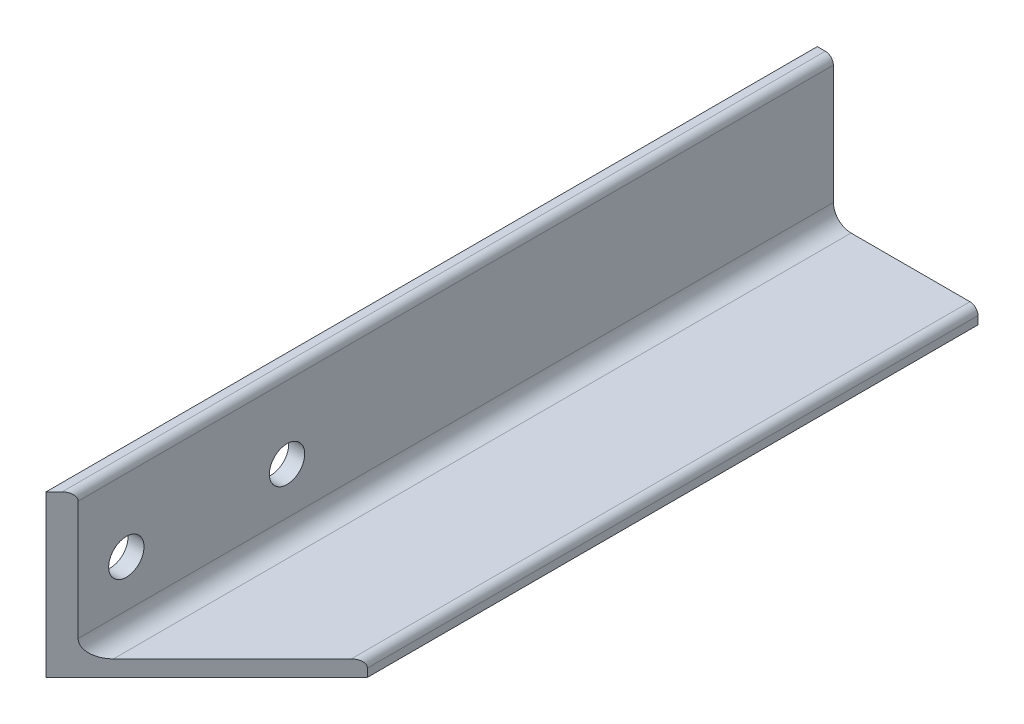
ISO-10303-21;
HEADER;
FILE_DESCRIPTION(('STEP AP214'),'2;1');
FILE_NAME('part.step','',(''),(''),'','','');
FILE_SCHEMA(('AUTOMOTIVE_DESIGN { 1 0 10303 214 1 1 1 1 }'));
ENDSEC;
DATA;
#1=APPLICATION_CONTEXT('core data for automotive mechanical design processes');
#2=APPLICATION_PROTOCOL_DEFINITION('international standard','automotive_design',2000,#1);
#3=PRODUCT_CONTEXT('',#1,'mechanical');
#4=PRODUCT('Part','Part','',(#3));
#5=PRODUCT_RELATED_PRODUCT_CATEGORY('part','',(#4));
#6=PRODUCT_DEFINITION_FORMATION('','',#4);
#7=PRODUCT_DEFINITION_CONTEXT('part definition',#1,'design');
#8=PRODUCT_DEFINITION('design','',#6,#7);
#9=PRODUCT_DEFINITION_SHAPE('','',#8);
#10=(LENGTH_UNIT() NAMED_UNIT(*) SI_UNIT(.MILLI.,.METRE.));
#11=(NAMED_UNIT(*) PLANE_ANGLE_UNIT() SI_UNIT($,.RADIAN.));
#12=(NAMED_UNIT(*) SI_UNIT($,.STERADIAN.) SOLID_ANGLE_UNIT());
#13=UNCERTAINTY_MEASURE_WITH_UNIT(LENGTH_MEASURE(1.E-05),#10,'distance_accuracy_value','');
#14=(GEOMETRIC_REPRESENTATION_CONTEXT(3) GLOBAL_UNCERTAINTY_ASSIGNED_CONTEXT((#13)) GLOBAL_UNIT_ASSIGNED_CONTEXT((#10,
#11,#12)) REPRESENTATION_CONTEXT('',''));
#15=CARTESIAN_POINT('',(0.,0.,0.));
#16=DIRECTION('',(0.,0.,1.));
#17=DIRECTION('',(1.,0.,0.));
#18=AXIS2_PLACEMENT_3D('',#15,#16,#17);
#19=CARTESIAN_POINT('',(2.49999999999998,50.0000000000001,240.));
#20=DIRECTION('',(0.,-1.,0.));
#21=DIRECTION('',(0.,0.,-1.));
#22=AXIS2_PLACEMENT_3D('',#19,#20,#21);
#23=PLANE('',#22);
#24=DIRECTION('',(0.,0.,-1.));
#25=VECTOR('',#24,1.);
#26=CARTESIAN_POINT('',(0.,50.0000000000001,240.));
#27=LINE('',#26,#25);
#28=CARTESIAN_POINT('',(0.,50.0000000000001,240.));
#29=VERTEX_POINT('',#28);
#30=CARTESIAN_POINT('',(0.,50.,0.));
#31=VERTEX_POINT('',#30);
#32=EDGE_CURVE('E11',#29,#31,#27,.T.);
#33=ORIENTED_EDGE('',*,*,#32,.F.);
#34=DIRECTION('',(0.707106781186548,0.,-0.707106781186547));
#35=VECTOR('',#34,1.);
#36=CARTESIAN_POINT('',(1.24999999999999,50.0000000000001,238.75));
#37=LINE('',#36,#35);
#38=CARTESIAN_POINT('',(2.49999999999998,50.0000000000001,237.5));
#39=VERTEX_POINT('',#38);
#40=EDGE_CURVE('E57',#29,#39,#37,.T.);
#41=ORIENTED_EDGE('',*,*,#40,.T.);
#42=DIRECTION('',(0.,0.,-1.));
#43=VECTOR('',#42,1.);
#44=CARTESIAN_POINT('',(2.49999999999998,50.0000000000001,240.));
#45=LINE('',#44,#43);
#46=CARTESIAN_POINT('',(2.49999999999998,50.,0.));
#47=VERTEX_POINT('',#46);
#48=EDGE_CURVE('E64',#39,#47,#45,.T.);
#49=ORIENTED_EDGE('',*,*,#48,.T.);
#50=DIRECTION('',(-1.,0.,0.));
#51=VECTOR('',#50,1.);
#52=CARTESIAN_POINT('',(2.49999999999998,50.,0.));
#53=LINE('',#52,#51);
#54=EDGE_CURVE('E166',#47,#31,#53,.T.);
#55=ORIENTED_EDGE('',*,*,#54,.T.);
#56=EDGE_LOOP('',(#33,#41,#49,#55));
#57=FACE_BOUND('',#56,.T.);
#58=ADVANCED_FACE('F41',(#57),#23,.F.);
#59=CARTESIAN_POINT('',(0.,50.0000000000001,240.));
#60=DIRECTION('',(1.,0.,0.));
#61=DIRECTION('',(0.,1.,0.));
#62=AXIS2_PLACEMENT_3D('',#59,#60,#61);
#63=PLANE('',#62);
#64=CARTESIAN_POINT('',(0.,25.,170.));
#65=DIRECTION('',(-1.,0.,0.));
#66=DIRECTION('',(0.,-1.,0.));
#67=AXIS2_PLACEMENT_3D('',#64,#65,#66);
#68=CIRCLE('',#67,5.50000000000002);
#69=CARTESIAN_POINT('',(0.,19.5,170.));
#70=VERTEX_POINT('',#69);
#71=EDGE_CURVE('E146',#70,#70,#68,.T.);
#72=ORIENTED_EDGE('',*,*,#71,.F.);
#73=EDGE_LOOP('',(#72));
#74=FACE_BOUND('',#73,.T.);
#75=CARTESIAN_POINT('',(0.,25.,220.));
#76=DIRECTION('',(-1.,0.,0.));
#77=DIRECTION('',(0.,-1.,0.));
#78=AXIS2_PLACEMENT_3D('',#75,#76,#77);
#79=CIRCLE('',#78,5.50000000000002);
#80=CARTESIAN_POINT('',(0.,19.5,220.));
#81=VERTEX_POINT('',#80);
#82=EDGE_CURVE('E138',#81,#81,#79,.T.);
#83=ORIENTED_EDGE('',*,*,#82,.F.);
#84=EDGE_LOOP('',(#83));
#85=FACE_BOUND('',#84,.T.);
#86=DIRECTION('',(0.,-1.,0.));
#87=VECTOR('',#86,1.);
#88=CARTESIAN_POINT('',(0.,50.,0.));
#89=LINE('',#88,#87);
#90=CARTESIAN_POINT('',(0.,0.,0.));
#91=VERTEX_POINT('',#90);
#92=EDGE_CURVE('E132',#31,#91,#89,.T.);
#93=ORIENTED_EDGE('',*,*,#92,.T.);
#94=DIRECTION('',(0.,0.,-1.));
#95=VECTOR('',#94,1.);
#96=CARTESIAN_POINT('',(0.,1.11022302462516E-13,240.));
#97=LINE('',#96,#95);
#98=CARTESIAN_POINT('',(0.,1.11022302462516E-13,240.));
#99=VERTEX_POINT('',#98);
#100=EDGE_CURVE('E49',#99,#91,#97,.T.);
#101=ORIENTED_EDGE('',*,*,#100,.F.);
#102=DIRECTION('',(0.,-1.,0.));
#103=VECTOR('',#102,1.);
#104=CARTESIAN_POINT('',(0.,50.0000000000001,240.));
#105=LINE('',#104,#103);
#106=EDGE_CURVE('E111',#29,#99,#105,.T.);
#107=ORIENTED_EDGE('',*,*,#106,.F.);
#108=ORIENTED_EDGE('',*,*,#32,.T.);
#109=EDGE_LOOP('',(#93,#101,#107,#108));
#110=FACE_BOUND('',#109,.T.);
#111=ADVANCED_FACE('F131',(#74,#85,#110),#63,.F.);
#112=CARTESIAN_POINT('',(0.,1.11022302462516E-13,240.));
#113=DIRECTION('',(0.,1.,0.));
#114=DIRECTION('',(0.,0.,1.));
#115=AXIS2_PLACEMENT_3D('',#112,#113,#114);
#116=PLANE('',#115);
#117=DIRECTION('',(0.,0.,-1.));
#118=VECTOR('',#117,1.);
#119=CARTESIAN_POINT('',(50.0000000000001,1.11022302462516E-13,240.));
#120=LINE('',#119,#118);
#121=CARTESIAN_POINT('',(50.,0.,190.));
#122=VERTEX_POINT('',#121);
#123=CARTESIAN_POINT('',(50.,0.,0.));
#124=VERTEX_POINT('',#123);
#125=EDGE_CURVE('E127',#122,#124,#120,.T.);
#126=ORIENTED_EDGE('',*,*,#125,.F.);
#127=DIRECTION('',(0.707106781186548,0.,-0.707106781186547));
#128=VECTOR('',#127,1.);
#129=CARTESIAN_POINT('',(50.,0.,190.));
#130=LINE('',#129,#128);
#131=EDGE_CURVE('E114',#99,#122,#130,.T.);
#132=ORIENTED_EDGE('',*,*,#131,.F.);
#133=ORIENTED_EDGE('',*,*,#100,.T.);
#134=DIRECTION('',(1.,0.,0.));
#135=VECTOR('',#134,1.);
#136=CARTESIAN_POINT('',(0.,0.,0.));
#137=LINE('',#136,#135);
#138=EDGE_CURVE('E169',#91,#124,#137,.T.);
#139=ORIENTED_EDGE('',*,*,#138,.T.);
#140=EDGE_LOOP('',(#126,#132,#133,#139));
#141=FACE_BOUND('',#140,.T.);
#142=ADVANCED_FACE('F124',(#141),#116,.F.);
#143=CARTESIAN_POINT('',(50.0000000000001,1.11022302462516E-13,240.));
#144=DIRECTION('',(-1.,0.,0.));
#145=DIRECTION('',(0.,0.,1.));
#146=AXIS2_PLACEMENT_3D('',#143,#144,#145);
#147=PLANE('',#146);
#148=DIRECTION('',(0.,0.,-1.));
#149=VECTOR('',#148,1.);
#150=CARTESIAN_POINT('',(50.0000000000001,2.50000000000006,240.));
#151=LINE('',#150,#149);
#152=CARTESIAN_POINT('',(50.,2.5,190.));
#153=VERTEX_POINT('',#152);
#154=CARTESIAN_POINT('',(50.,2.5,0.));
#155=VERTEX_POINT('',#154);
#156=EDGE_CURVE('E134',#153,#155,#151,.T.);
#157=ORIENTED_EDGE('',*,*,#156,.F.);
#158=DIRECTION('',(0.,-1.,0.));
#159=VECTOR('',#158,1.);
#160=CARTESIAN_POINT('',(50.0000000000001,240.,190.));
#161=LINE('',#160,#159);
#162=EDGE_CURVE('E128',#153,#122,#161,.T.);
#163=ORIENTED_EDGE('',*,*,#162,.T.);
#164=ORIENTED_EDGE('',*,*,#125,.T.);
#165=DIRECTION('',(0.,1.,0.));
#166=VECTOR('',#165,1.);
#167=CARTESIAN_POINT('',(50.,0.,0.));
#168=LINE('',#167,#166);
#169=EDGE_CURVE('E171',#124,#155,#168,.T.);
#170=ORIENTED_EDGE('',*,*,#169,.T.);
#171=EDGE_LOOP('',(#157,#163,#164,#170));
#172=FACE_BOUND('',#171,.T.);
#173=ADVANCED_FACE('F203',(#172),#147,.F.);
#174=CARTESIAN_POINT('',(47.5000000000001,2.50000000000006,240.));
#175=DIRECTION('',(0.,0.,-1.));
#176=DIRECTION('',(-1.,0.,0.));
#177=AXIS2_PLACEMENT_3D('',#174,#175,#176);
#178=CYLINDRICAL_SURFACE('',#177,2.5);
#179=DIRECTION('',(0.,0.,-1.));
#180=VECTOR('',#179,1.);
#181=CARTESIAN_POINT('',(47.5,5.00000000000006,240.));
#182=LINE('',#181,#180);
#183=CARTESIAN_POINT('',(47.5,5.,192.5));
#184=VERTEX_POINT('',#183);
#185=CARTESIAN_POINT('',(47.5,5.,0.));
#186=VERTEX_POINT('',#185);
#187=EDGE_CURVE('E194',#184,#186,#182,.T.);
#188=ORIENTED_EDGE('',*,*,#187,.F.);
#189=CARTESIAN_POINT('',(47.5,2.5,192.5));
#190=DIRECTION('',(-0.707106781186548,0.,-0.707106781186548));
#191=DIRECTION('',(0.707106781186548,0.,-0.707106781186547));
#192=AXIS2_PLACEMENT_3D('',#189,#190,#191);
#193=ELLIPSE('',#192,3.53553390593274,2.5);
#194=EDGE_CURVE('E162',#184,#153,#193,.T.);
#195=ORIENTED_EDGE('',*,*,#194,.T.);
#196=ORIENTED_EDGE('',*,*,#156,.T.);
#197=CARTESIAN_POINT('',(47.5,2.5,0.));
#198=DIRECTION('',(0.,0.,1.));
#199=DIRECTION('',(1.,0.,0.));
#200=AXIS2_PLACEMENT_3D('',#197,#198,#199);
#201=CIRCLE('',#200,2.5);
#202=EDGE_CURVE('E174',#155,#186,#201,.T.);
#203=ORIENTED_EDGE('',*,*,#202,.T.);
#204=EDGE_LOOP('',(#188,#195,#196,#203));
#205=FACE_BOUND('',#204,.T.);
#206=ADVANCED_FACE('F198',(#205),#178,.T.);
#207=CARTESIAN_POINT('',(47.5,5.00000000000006,240.));
#208=DIRECTION('',(0.,-1.,0.));
#209=DIRECTION('',(1.,0.,0.));
#210=AXIS2_PLACEMENT_3D('',#207,#208,#209);
#211=PLANE('',#210);
#212=DIRECTION('',(0.,0.,-1.));
#213=VECTOR('',#212,1.);
#214=CARTESIAN_POINT('',(10.5,5.00000000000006,240.));
#215=LINE('',#214,#213);
#216=CARTESIAN_POINT('',(10.5,5.,229.5));
#217=VERTEX_POINT('',#216);
#218=CARTESIAN_POINT('',(10.5,5.,0.));
#219=VERTEX_POINT('',#218);
#220=EDGE_CURVE('E192',#217,#219,#215,.T.);
#221=ORIENTED_EDGE('',*,*,#220,.F.);
#222=DIRECTION('',(0.707106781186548,0.,-0.707106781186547));
#223=VECTOR('',#222,1.);
#224=CARTESIAN_POINT('',(23.75,5.,216.25));
#225=LINE('',#224,#223);
#226=EDGE_CURVE('E159',#217,#184,#225,.T.);
#227=ORIENTED_EDGE('',*,*,#226,.T.);
#228=ORIENTED_EDGE('',*,*,#187,.T.);
#229=DIRECTION('',(-1.,0.,0.));
#230=VECTOR('',#229,1.);
#231=CARTESIAN_POINT('',(47.5,5.,0.));
#232=LINE('',#231,#230);
#233=EDGE_CURVE('E177',#186,#219,#232,.T.);
#234=ORIENTED_EDGE('',*,*,#233,.T.);
#235=EDGE_LOOP('',(#221,#227,#228,#234));
#236=FACE_BOUND('',#235,.T.);
#237=ADVANCED_FACE('F211',(#236),#211,.F.);
#238=CARTESIAN_POINT('',(10.5,10.5000000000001,240.));
#239=DIRECTION('',(0.,0.,-1.));
#240=DIRECTION('',(-1.,0.,0.));
#241=AXIS2_PLACEMENT_3D('',#238,#239,#240);
#242=CYLINDRICAL_SURFACE('',#241,5.5);
#243=DIRECTION('',(0.,0.,-1.));
#244=VECTOR('',#243,1.);
#245=CARTESIAN_POINT('',(5.,10.5000000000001,240.));
#246=LINE('',#245,#244);
#247=CARTESIAN_POINT('',(5.00000000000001,10.5,235.));
#248=VERTEX_POINT('',#247);
#249=CARTESIAN_POINT('',(5.,10.5,0.));
#250=VERTEX_POINT('',#249);
#251=EDGE_CURVE('E190',#248,#250,#246,.T.);
#252=ORIENTED_EDGE('',*,*,#251,.F.);
#253=CARTESIAN_POINT('',(10.5,10.5,229.5));
#254=DIRECTION('',(-0.707106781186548,0.,-0.707106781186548));
#255=DIRECTION('',(0.707106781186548,0.,-0.707106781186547));
#256=AXIS2_PLACEMENT_3D('',#253,#254,#255);
#257=ELLIPSE('',#256,7.77817459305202,5.5);
#258=EDGE_CURVE('E156',#248,#217,#257,.F.);
#259=ORIENTED_EDGE('',*,*,#258,.T.);
#260=ORIENTED_EDGE('',*,*,#220,.T.);
#261=CARTESIAN_POINT('',(10.5,10.5,0.));
#262=DIRECTION('',(0.,0.,-1.));
#263=DIRECTION('',(-1.,0.,0.));
#264=AXIS2_PLACEMENT_3D('',#261,#262,#263);
#265=CIRCLE('',#264,5.5);
#266=EDGE_CURVE('E180',#219,#250,#265,.T.);
#267=ORIENTED_EDGE('',*,*,#266,.T.);
#268=EDGE_LOOP('',(#252,#259,#260,#267));
#269=FACE_BOUND('',#268,.T.);
#270=ADVANCED_FACE('F214',(#269),#242,.F.);
#271=CARTESIAN_POINT('',(5.,10.5000000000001,240.));
#272=DIRECTION('',(-1.,0.,0.));
#273=DIRECTION('',(0.,0.,1.));
#274=AXIS2_PLACEMENT_3D('',#271,#272,#273);
#275=PLANE('',#274);
#276=CARTESIAN_POINT('',(5.,25.,170.));
#277=DIRECTION('',(-1.,0.,0.));
#278=DIRECTION('',(0.,0.,1.));
#279=AXIS2_PLACEMENT_3D('',#276,#277,#278);
#280=CIRCLE('',#279,5.50000000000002);
#281=CARTESIAN_POINT('',(5.,25.,175.5));
#282=VERTEX_POINT('',#281);
#283=EDGE_CURVE('E44',#282,#282,#280,.T.);
#284=ORIENTED_EDGE('',*,*,#283,.T.);
#285=EDGE_LOOP('',(#284));
#286=FACE_BOUND('',#285,.T.);
#287=CARTESIAN_POINT('',(5.,25.,220.));
#288=DIRECTION('',(-1.,0.,0.));
#289=DIRECTION('',(0.,0.,1.));
#290=AXIS2_PLACEMENT_3D('',#287,#288,#289);
#291=CIRCLE('',#290,5.50000000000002);
#292=CARTESIAN_POINT('',(5.,25.,225.5));
#293=VERTEX_POINT('',#292);
#294=EDGE_CURVE('E129',#293,#293,#291,.T.);
#295=ORIENTED_EDGE('',*,*,#294,.T.);
#296=EDGE_LOOP('',(#295));
#297=FACE_BOUND('',#296,.T.);
#298=DIRECTION('',(0.,0.,-1.));
#299=VECTOR('',#298,1.);
#300=CARTESIAN_POINT('',(5.,47.5000000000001,240.));
#301=LINE('',#300,#299);
#302=CARTESIAN_POINT('',(5.,47.5,235.));
#303=VERTEX_POINT('',#302);
#304=CARTESIAN_POINT('',(5.,47.5,0.));
#305=VERTEX_POINT('',#304);
#306=EDGE_CURVE('E188',#303,#305,#301,.T.);
#307=ORIENTED_EDGE('',*,*,#306,.F.);
#308=DIRECTION('',(0.,-1.,0.));
#309=VECTOR('',#308,1.);
#310=CARTESIAN_POINT('',(5.00000000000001,10.5,235.));
#311=LINE('',#310,#309);
#312=EDGE_CURVE('E153',#303,#248,#311,.T.);
#313=ORIENTED_EDGE('',*,*,#312,.T.);
#314=ORIENTED_EDGE('',*,*,#251,.T.);
#315=DIRECTION('',(0.,1.,0.));
#316=VECTOR('',#315,1.);
#317=CARTESIAN_POINT('',(5.,10.5,0.));
#318=LINE('',#317,#316);
#319=EDGE_CURVE('E183',#250,#305,#318,.T.);
#320=ORIENTED_EDGE('',*,*,#319,.T.);
#321=EDGE_LOOP('',(#307,#313,#314,#320));
#322=FACE_BOUND('',#321,.T.);
#323=ADVANCED_FACE('F217',(#286,#297,#322),#275,.F.);
#324=CARTESIAN_POINT('',(2.5,47.5000000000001,240.));
#325=DIRECTION('',(0.,0.,-1.));
#326=DIRECTION('',(-1.,0.,0.));
#327=AXIS2_PLACEMENT_3D('',#324,#325,#326);
#328=CYLINDRICAL_SURFACE('',#327,2.5);
#329=ORIENTED_EDGE('',*,*,#48,.F.);
#330=CARTESIAN_POINT('',(2.5,47.5000000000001,237.5));
#331=DIRECTION('',(-0.707106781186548,0.,-0.707106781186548));
#332=DIRECTION('',(0.707106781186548,0.,-0.707106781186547));
#333=AXIS2_PLACEMENT_3D('',#330,#331,#332);
#334=ELLIPSE('',#333,3.53553390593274,2.5);
#335=EDGE_CURVE('E150',#39,#303,#334,.T.);
#336=ORIENTED_EDGE('',*,*,#335,.T.);
#337=ORIENTED_EDGE('',*,*,#306,.T.);
#338=CARTESIAN_POINT('',(2.5,47.5,0.));
#339=DIRECTION('',(0.,0.,1.));
#340=DIRECTION('',(1.,0.,0.));
#341=AXIS2_PLACEMENT_3D('',#338,#339,#340);
#342=CIRCLE('',#341,2.5);
#343=EDGE_CURVE('E119',#305,#47,#342,.T.);
#344=ORIENTED_EDGE('',*,*,#343,.T.);
#345=EDGE_LOOP('',(#329,#336,#337,#344));
#346=FACE_BOUND('',#345,.T.);
#347=ADVANCED_FACE('F220',(#346),#328,.T.);
#348=CARTESIAN_POINT('',(47.5,2.5,0.));
#349=DIRECTION('',(0.,0.,1.));
#350=DIRECTION('',(1.,0.,0.));
#351=AXIS2_PLACEMENT_3D('',#348,#349,#350);
#352=PLANE('',#351);
#353=ORIENTED_EDGE('',*,*,#54,.F.);
#354=ORIENTED_EDGE('',*,*,#343,.F.);
#355=ORIENTED_EDGE('',*,*,#319,.F.);
#356=ORIENTED_EDGE('',*,*,#266,.F.);
#357=ORIENTED_EDGE('',*,*,#233,.F.);
#358=ORIENTED_EDGE('',*,*,#202,.F.);
#359=ORIENTED_EDGE('',*,*,#169,.F.);
#360=ORIENTED_EDGE('',*,*,#138,.F.);
#361=ORIENTED_EDGE('',*,*,#92,.F.);
#362=EDGE_LOOP('',(#353,#354,#355,#356,#357,#358,#359,#360,#361));
#363=FACE_BOUND('',#362,.T.);
#364=ADVANCED_FACE('F206',(#363),#352,.F.);
#365=CARTESIAN_POINT('',(50.0000000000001,240.,190.));
#366=DIRECTION('',(-0.707106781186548,0.,-0.707106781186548));
#367=DIRECTION('',(-0.707106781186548,0.,0.707106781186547));
#368=AXIS2_PLACEMENT_3D('',#365,#366,#367);
#369=PLANE('',#368);
#370=ORIENTED_EDGE('',*,*,#106,.T.);
#371=ORIENTED_EDGE('',*,*,#131,.T.);
#372=ORIENTED_EDGE('',*,*,#162,.F.);
#373=ORIENTED_EDGE('',*,*,#194,.F.);
#374=ORIENTED_EDGE('',*,*,#226,.F.);
#375=ORIENTED_EDGE('',*,*,#258,.F.);
#376=ORIENTED_EDGE('',*,*,#312,.F.);
#377=ORIENTED_EDGE('',*,*,#335,.F.);
#378=ORIENTED_EDGE('',*,*,#40,.F.);
#379=EDGE_LOOP('',(#370,#371,#372,#373,#374,#375,#376,#377,#378));
#380=FACE_BOUND('',#379,.T.);
#381=ADVANCED_FACE('F113',(#380),#369,.F.);
#382=CARTESIAN_POINT('',(240.,25.,220.));
#383=DIRECTION('',(-1.,0.,0.));
#384=DIRECTION('',(0.,-1.,0.));
#385=AXIS2_PLACEMENT_3D('',#382,#383,#384);
#386=CYLINDRICAL_SURFACE('',#385,5.50000000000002);
#387=ORIENTED_EDGE('',*,*,#82,.T.);
#388=EDGE_LOOP('',(#387));
#389=FACE_BOUND('',#388,.T.);
#390=ORIENTED_EDGE('',*,*,#294,.F.);
#391=EDGE_LOOP('',(#390));
#392=FACE_BOUND('',#391,.T.);
#393=ADVANCED_FACE('F250',(#389,#392),#386,.F.);
#394=CARTESIAN_POINT('',(240.,25.,170.));
#395=DIRECTION('',(-1.,0.,0.));
#396=DIRECTION('',(0.,-1.,0.));
#397=AXIS2_PLACEMENT_3D('',#394,#395,#396);
#398=CYLINDRICAL_SURFACE('',#397,5.50000000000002);
#399=ORIENTED_EDGE('',*,*,#71,.T.);
#400=EDGE_LOOP('',(#399));
#401=FACE_BOUND('',#400,.T.);
#402=ORIENTED_EDGE('',*,*,#283,.F.);
#403=EDGE_LOOP('',(#402));
#404=FACE_BOUND('',#403,.T.);
#405=ADVANCED_FACE('F253',(#401,#404),#398,.F.);
#406=CLOSED_SHELL('',(#58,#111,#142,#173,#206,#237,#270,#323,#347,#364,#381,#393,#405));
#407=MANIFOLD_SOLID_BREP('B2',#406);
#408=ADVANCED_BREP_SHAPE_REPRESENTATION('',(#18,#407),#14);
#409=SHAPE_DEFINITION_REPRESENTATION(#9,#408);
ENDSEC;
END-ISO-10303-21;
